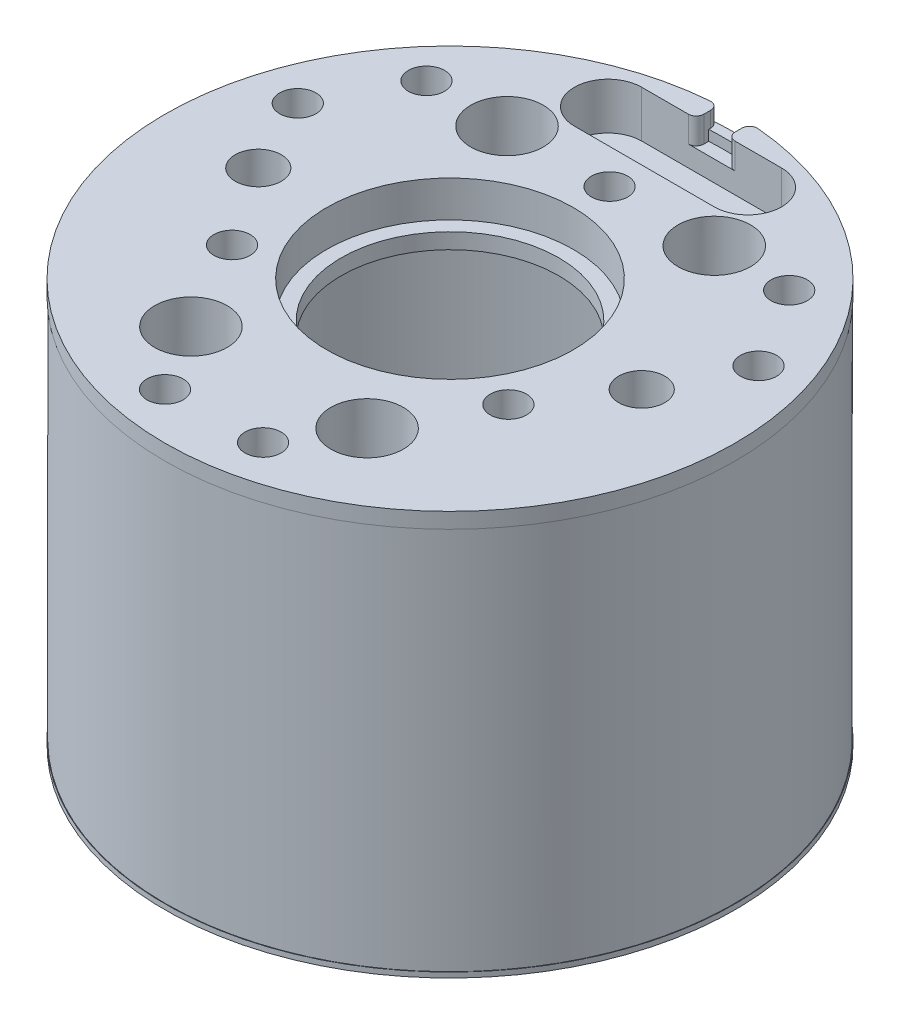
ISO-10303-21;
HEADER;
FILE_DESCRIPTION(('STEP AP214'),'2;1');
FILE_NAME('part.step','',(''),(''),'','','');
FILE_SCHEMA(('AUTOMOTIVE_DESIGN { 1 0 10303 214 1 1 1 1 }'));
ENDSEC;
DATA;
#1=APPLICATION_CONTEXT('core data for automotive mechanical design processes');
#2=APPLICATION_PROTOCOL_DEFINITION('international standard','automotive_design',2000,#1);
#3=PRODUCT_CONTEXT('',#1,'mechanical');
#4=PRODUCT('Part','Part','',(#3));
#5=PRODUCT_RELATED_PRODUCT_CATEGORY('part','',(#4));
#6=PRODUCT_DEFINITION_FORMATION('','',#4);
#7=PRODUCT_DEFINITION_CONTEXT('part definition',#1,'design');
#8=PRODUCT_DEFINITION('design','',#6,#7);
#9=PRODUCT_DEFINITION_SHAPE('','',#8);
#10=(LENGTH_UNIT() NAMED_UNIT(*) SI_UNIT(.MILLI.,.METRE.));
#11=(NAMED_UNIT(*) PLANE_ANGLE_UNIT() SI_UNIT($,.RADIAN.));
#12=(NAMED_UNIT(*) SI_UNIT($,.STERADIAN.) SOLID_ANGLE_UNIT());
#13=UNCERTAINTY_MEASURE_WITH_UNIT(LENGTH_MEASURE(1.E-05),#10,'distance_accuracy_value','');
#14=(GEOMETRIC_REPRESENTATION_CONTEXT(3) GLOBAL_UNCERTAINTY_ASSIGNED_CONTEXT((#13)) GLOBAL_UNIT_ASSIGNED_CONTEXT((#10,
#11,#12)) REPRESENTATION_CONTEXT('',''));
#15=CARTESIAN_POINT('',(0.,0.,0.));
#16=DIRECTION('',(0.,0.,1.));
#17=DIRECTION('',(1.,0.,0.));
#18=AXIS2_PLACEMENT_3D('',#15,#16,#17);
#19=CARTESIAN_POINT('',(13.462,-19.558,0.));
#20=DIRECTION('',(0.,1.,0.));
#21=DIRECTION('',(0.,0.,1.));
#22=AXIS2_PLACEMENT_3D('',#19,#20,#21);
#23=PLANE('',#22);
#24=CARTESIAN_POINT('',(0.,-19.558,0.));
#25=DIRECTION('',(0.,-1.,0.));
#26=DIRECTION('',(0.,0.,-1.));
#27=AXIS2_PLACEMENT_3D('',#24,#25,#26);
#28=CIRCLE('',#27,13.97);
#29=CARTESIAN_POINT('',(0.,-19.558,-13.97));
#30=VERTEX_POINT('',#29);
#31=EDGE_CURVE('E222',#30,#30,#28,.T.);
#32=ORIENTED_EDGE('',*,*,#31,.F.);
#33=EDGE_LOOP('',(#32));
#34=FACE_BOUND('',#33,.T.);
#35=CARTESIAN_POINT('',(0.,-19.558,0.));
#36=DIRECTION('',(0.,1.,0.));
#37=DIRECTION('',(0.,0.,1.));
#38=AXIS2_PLACEMENT_3D('',#35,#36,#37);
#39=CIRCLE('',#38,13.9446);
#40=CARTESIAN_POINT('',(0.,-19.558,13.9446));
#41=VERTEX_POINT('',#40);
#42=EDGE_CURVE('E376',#41,#41,#39,.T.);
#43=ORIENTED_EDGE('',*,*,#42,.F.);
#44=EDGE_LOOP('',(#43));
#45=FACE_BOUND('',#44,.T.);
#46=ADVANCED_FACE('F31',(#34,#45),#23,.T.);
#47=CARTESIAN_POINT('',(13.97,-0.762,0.));
#48=DIRECTION('',(0.,-1.,0.));
#49=DIRECTION('',(0.,0.,-1.));
#50=AXIS2_PLACEMENT_3D('',#47,#48,#49);
#51=PLANE('',#50);
#52=CARTESIAN_POINT('',(-1.143,-0.762,-13.540844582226));
#53=DIRECTION('',(0.,-1.,0.));
#54=DIRECTION('',(0.,0.,-1.));
#55=AXIS2_PLACEMENT_3D('',#52,#53,#54);
#56=CIRCLE('',#55,0.381);
#57=CARTESIAN_POINT('',(-1.17504672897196,-0.762000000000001,-13.9204944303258));
#58=VERTEX_POINT('',#57);
#59=CARTESIAN_POINT('',(-1.0347837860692,-0.762,-13.9061530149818));
#60=VERTEX_POINT('',#59);
#61=EDGE_CURVE('E164',#58,#60,#56,.T.);
#62=ORIENTED_EDGE('',*,*,#61,.T.);
#63=CARTESIAN_POINT('',(0.,-0.762000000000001,0.));
#64=DIRECTION('',(0.,1.,0.));
#65=DIRECTION('',(0.,0.,1.));
#66=AXIS2_PLACEMENT_3D('',#63,#64,#65);
#67=CIRCLE('',#66,13.9446);
#68=CARTESIAN_POINT('',(1.0347837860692,-0.762,-13.9061530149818));
#69=VERTEX_POINT('',#68);
#70=EDGE_CURVE('E46',#60,#69,#67,.T.);
#71=ORIENTED_EDGE('',*,*,#70,.T.);
#72=CARTESIAN_POINT('',(1.143,-0.762,-13.540844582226));
#73=DIRECTION('',(0.,-1.,0.));
#74=DIRECTION('',(0.,0.,-1.));
#75=AXIS2_PLACEMENT_3D('',#72,#73,#74);
#76=CIRCLE('',#75,0.381);
#77=CARTESIAN_POINT('',(1.17504672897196,-0.762000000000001,-13.9204944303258));
#78=VERTEX_POINT('',#77);
#79=EDGE_CURVE('E167',#69,#78,#76,.T.);
#80=ORIENTED_EDGE('',*,*,#79,.T.);
#81=CARTESIAN_POINT('',(0.,-0.762000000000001,0.));
#82=DIRECTION('',(0.,-1.,0.));
#83=DIRECTION('',(0.,0.,-1.));
#84=AXIS2_PLACEMENT_3D('',#81,#82,#83);
#85=CIRCLE('',#84,13.97);
#86=EDGE_CURVE('E225',#78,#58,#85,.T.);
#87=ORIENTED_EDGE('',*,*,#86,.T.);
#88=EDGE_LOOP('',(#62,#71,#80,#87));
#89=FACE_BOUND('',#88,.T.);
#90=ADVANCED_FACE('F393',(#89),#51,.T.);
#91=CARTESIAN_POINT('',(13.208,-2.54,0.));
#92=DIRECTION('',(0.,-1.,0.));
#93=DIRECTION('',(0.,0.,-1.));
#94=AXIS2_PLACEMENT_3D('',#91,#92,#93);
#95=PLANE('',#94);
#96=CARTESIAN_POINT('',(4.318,-2.54,8.382));
#97=DIRECTION('',(0.,-1.,0.));
#98=DIRECTION('',(0.,0.,-1.));
#99=AXIS2_PLACEMENT_3D('',#96,#97,#98);
#100=CIRCLE('',#99,1.778);
#101=CARTESIAN_POINT('',(4.318,-2.54,6.604));
#102=VERTEX_POINT('',#101);
#103=EDGE_CURVE('E327',#102,#102,#100,.T.);
#104=ORIENTED_EDGE('',*,*,#103,.F.);
#105=EDGE_LOOP('',(#104));
#106=FACE_BOUND('',#105,.T.);
#107=CARTESIAN_POINT('',(-4.318,-2.54,8.382));
#108=DIRECTION('',(0.,-1.,0.));
#109=DIRECTION('',(0.,0.,-1.));
#110=AXIS2_PLACEMENT_3D('',#107,#108,#109);
#111=CIRCLE('',#110,1.778);
#112=CARTESIAN_POINT('',(-4.318,-2.54,6.604));
#113=VERTEX_POINT('',#112);
#114=EDGE_CURVE('E321',#113,#113,#111,.T.);
#115=ORIENTED_EDGE('',*,*,#114,.F.);
#116=EDGE_LOOP('',(#115));
#117=FACE_BOUND('',#116,.T.);
#118=CARTESIAN_POINT('',(5.08,-2.54,-7.874));
#119=DIRECTION('',(0.,-1.,0.));
#120=DIRECTION('',(0.,0.,-1.));
#121=AXIS2_PLACEMENT_3D('',#118,#119,#120);
#122=CIRCLE('',#121,1.778);
#123=CARTESIAN_POINT('',(5.08,-2.54,-9.652));
#124=VERTEX_POINT('',#123);
#125=EDGE_CURVE('E315',#124,#124,#122,.T.);
#126=ORIENTED_EDGE('',*,*,#125,.F.);
#127=EDGE_LOOP('',(#126));
#128=FACE_BOUND('',#127,.T.);
#129=CARTESIAN_POINT('',(-5.08,-2.54,-7.874));
#130=DIRECTION('',(0.,-1.,0.));
#131=DIRECTION('',(0.,0.,-1.));
#132=AXIS2_PLACEMENT_3D('',#129,#130,#131);
#133=CIRCLE('',#132,1.778);
#134=CARTESIAN_POINT('',(-5.08,-2.54,-9.652));
#135=VERTEX_POINT('',#134);
#136=EDGE_CURVE('E309',#135,#135,#133,.T.);
#137=ORIENTED_EDGE('',*,*,#136,.F.);
#138=EDGE_LOOP('',(#137));
#139=FACE_BOUND('',#138,.T.);
#140=CARTESIAN_POINT('',(-9.398,-2.54,0.));
#141=DIRECTION('',(0.,-1.,0.));
#142=DIRECTION('',(0.,0.,-1.));
#143=AXIS2_PLACEMENT_3D('',#140,#141,#142);
#144=CIRCLE('',#143,1.1303);
#145=CARTESIAN_POINT('',(-9.398,-2.54,-1.1303));
#146=VERTEX_POINT('',#145);
#147=EDGE_CURVE('E303',#146,#146,#144,.T.);
#148=ORIENTED_EDGE('',*,*,#147,.F.);
#149=EDGE_LOOP('',(#148));
#150=FACE_BOUND('',#149,.T.);
#151=CARTESIAN_POINT('',(9.398,-2.54,0.));
#152=DIRECTION('',(0.,-1.,0.));
#153=DIRECTION('',(0.,0.,-1.));
#154=AXIS2_PLACEMENT_3D('',#151,#152,#153);
#155=CIRCLE('',#154,1.1303);
#156=CARTESIAN_POINT('',(9.398,-2.54,-1.1303));
#157=VERTEX_POINT('',#156);
#158=EDGE_CURVE('E297',#157,#157,#155,.T.);
#159=ORIENTED_EDGE('',*,*,#158,.F.);
#160=EDGE_LOOP('',(#159));
#161=FACE_BOUND('',#160,.T.);
#162=CARTESIAN_POINT('',(6.77382040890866,-2.54,3.91086703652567));
#163=DIRECTION('',(0.,-1.,0.));
#164=DIRECTION('',(0.,0.,-1.));
#165=AXIS2_PLACEMENT_3D('',#162,#163,#164);
#166=CIRCLE('',#165,0.888999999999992);
#167=CARTESIAN_POINT('',(6.77382040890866,-2.54,3.02186703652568));
#168=VERTEX_POINT('',#167);
#169=EDGE_CURVE('E291',#168,#168,#166,.T.);
#170=ORIENTED_EDGE('',*,*,#169,.F.);
#171=EDGE_LOOP('',(#170));
#172=FACE_BOUND('',#171,.T.);
#173=CARTESIAN_POINT('',(2.37164081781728,-2.54,11.5356657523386));
#174=DIRECTION('',(0.,-1.,0.));
#175=DIRECTION('',(0.,0.,-1.));
#176=AXIS2_PLACEMENT_3D('',#173,#174,#175);
#177=CIRCLE('',#176,0.888999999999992);
#178=CARTESIAN_POINT('',(2.37164081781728,-2.54,10.6466657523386));
#179=VERTEX_POINT('',#178);
#180=EDGE_CURVE('E285',#179,#179,#177,.T.);
#181=ORIENTED_EDGE('',*,*,#180,.F.);
#182=EDGE_LOOP('',(#181));
#183=FACE_BOUND('',#182,.T.);
#184=CARTESIAN_POINT('',(11.2616408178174,-2.54,-3.86226592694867));
#185=DIRECTION('',(0.,-1.,0.));
#186=DIRECTION('',(0.,0.,-1.));
#187=AXIS2_PLACEMENT_3D('',#184,#185,#186);
#188=CIRCLE('',#187,0.888999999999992);
#189=CARTESIAN_POINT('',(11.2616408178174,-2.54,-4.75126592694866));
#190=VERTEX_POINT('',#189);
#191=EDGE_CURVE('E279',#190,#190,#188,.T.);
#192=ORIENTED_EDGE('',*,*,#191,.F.);
#193=EDGE_LOOP('',(#192));
#194=FACE_BOUND('',#193,.T.);
#195=CARTESIAN_POINT('',(0.,-2.54,-7.82173407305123));
#196=DIRECTION('',(0.,-1.,0.));
#197=DIRECTION('',(0.,0.,-1.));
#198=AXIS2_PLACEMENT_3D('',#195,#196,#197);
#199=CIRCLE('',#198,0.888999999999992);
#200=CARTESIAN_POINT('',(0.,-2.54,-8.71073407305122));
#201=VERTEX_POINT('',#200);
#202=EDGE_CURVE('E273',#201,#201,#199,.T.);
#203=ORIENTED_EDGE('',*,*,#202,.F.);
#204=EDGE_LOOP('',(#203));
#205=FACE_BOUND('',#204,.T.);
#206=CARTESIAN_POINT('',(8.80435918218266,-2.54,-7.82173407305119));
#207=DIRECTION('',(0.,-1.,0.));
#208=DIRECTION('',(0.,0.,-1.));
#209=AXIS2_PLACEMENT_3D('',#206,#207,#208);
#210=CIRCLE('',#209,0.888999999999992);
#211=CARTESIAN_POINT('',(8.80435918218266,-2.54,-8.71073407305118));
#212=VERTEX_POINT('',#211);
#213=EDGE_CURVE('E267',#212,#212,#210,.T.);
#214=ORIENTED_EDGE('',*,*,#213,.F.);
#215=EDGE_LOOP('',(#214));
#216=FACE_BOUND('',#215,.T.);
#217=CARTESIAN_POINT('',(-8.97564081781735,-2.54,-7.82173407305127));
#218=DIRECTION('',(0.,-1.,0.));
#219=DIRECTION('',(0.,0.,-1.));
#220=AXIS2_PLACEMENT_3D('',#217,#218,#219);
#221=CIRCLE('',#220,0.888999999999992);
#222=CARTESIAN_POINT('',(-8.97564081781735,-2.54,-8.71073407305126));
#223=VERTEX_POINT('',#222);
#224=EDGE_CURVE('E261',#223,#223,#221,.T.);
#225=ORIENTED_EDGE('',*,*,#224,.F.);
#226=EDGE_LOOP('',(#225));
#227=FACE_BOUND('',#226,.T.);
#228=CARTESIAN_POINT('',(-6.77382040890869,-2.54,3.91086703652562));
#229=DIRECTION('',(0.,-1.,0.));
#230=DIRECTION('',(0.,0.,-1.));
#231=AXIS2_PLACEMENT_3D('',#228,#229,#230);
#232=CIRCLE('',#231,0.888999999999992);
#233=CARTESIAN_POINT('',(-6.77382040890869,-2.54,3.02186703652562));
#234=VERTEX_POINT('',#233);
#235=EDGE_CURVE('E255',#234,#234,#232,.T.);
#236=ORIENTED_EDGE('',*,*,#235,.F.);
#237=EDGE_LOOP('',(#236));
#238=FACE_BOUND('',#237,.T.);
#239=CARTESIAN_POINT('',(-11.176,-2.54,-3.71393167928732));
#240=DIRECTION('',(0.,-1.,0.));
#241=DIRECTION('',(0.,0.,-1.));
#242=AXIS2_PLACEMENT_3D('',#239,#240,#241);
#243=CIRCLE('',#242,0.888999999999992);
#244=CARTESIAN_POINT('',(-11.176,-2.54,-4.60293167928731));
#245=VERTEX_POINT('',#244);
#246=EDGE_CURVE('E249',#245,#245,#243,.T.);
#247=ORIENTED_EDGE('',*,*,#246,.F.);
#248=EDGE_LOOP('',(#247));
#249=FACE_BOUND('',#248,.T.);
#250=CARTESIAN_POINT('',(-2.286,-2.54,11.684));
#251=DIRECTION('',(0.,-1.,0.));
#252=DIRECTION('',(0.,0.,-1.));
#253=AXIS2_PLACEMENT_3D('',#250,#251,#252);
#254=CIRCLE('',#253,0.888999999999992);
#255=CARTESIAN_POINT('',(-2.286,-2.54,10.795));
#256=VERTEX_POINT('',#255);
#257=EDGE_CURVE('E243',#256,#256,#254,.T.);
#258=ORIENTED_EDGE('',*,*,#257,.F.);
#259=EDGE_LOOP('',(#258));
#260=FACE_BOUND('',#259,.T.);
#261=CARTESIAN_POINT('',(0.,-2.54,0.));
#262=DIRECTION('',(0.,-1.,0.));
#263=DIRECTION('',(0.,0.,-1.));
#264=AXIS2_PLACEMENT_3D('',#261,#262,#263);
#265=CIRCLE('',#264,13.208);
#266=CARTESIAN_POINT('',(0.,-2.54,-13.208));
#267=VERTEX_POINT('',#266);
#268=EDGE_CURVE('E212',#267,#267,#265,.T.);
#269=ORIENTED_EDGE('',*,*,#268,.T.);
#270=EDGE_LOOP('',(#269));
#271=FACE_BOUND('',#270,.T.);
#272=CARTESIAN_POINT('',(0.,-2.54,0.));
#273=DIRECTION('',(0.,-1.,0.));
#274=DIRECTION('',(0.,0.,-1.));
#275=AXIS2_PLACEMENT_3D('',#272,#273,#274);
#276=CIRCLE('',#275,5.334);
#277=CARTESIAN_POINT('',(0.,-2.54,-5.334));
#278=VERTEX_POINT('',#277);
#279=EDGE_CURVE('E240',#278,#278,#276,.T.);
#280=ORIENTED_EDGE('',*,*,#279,.F.);
#281=EDGE_LOOP('',(#280));
#282=FACE_BOUND('',#281,.T.);
#283=ADVANCED_FACE('F411',(#106,#117,#128,#139,#150,#161,#172,#183,#194,#205,#216,#227,#238,
#249,#260,#271,#282),#95,.T.);
#284=CARTESIAN_POINT('',(0.,0.,0.));
#285=DIRECTION('',(0.,-1.,0.));
#286=DIRECTION('',(0.,0.,-1.));
#287=AXIS2_PLACEMENT_3D('',#284,#285,#286);
#288=CYLINDRICAL_SURFACE('',#287,13.208);
#289=CARTESIAN_POINT('',(0.,-19.812,0.));
#290=DIRECTION('',(0.,-1.,0.));
#291=DIRECTION('',(0.,0.,-1.));
#292=AXIS2_PLACEMENT_3D('',#289,#290,#291);
#293=CIRCLE('',#292,13.208);
#294=CARTESIAN_POINT('',(0.,-19.812,-13.208));
#295=VERTEX_POINT('',#294);
#296=EDGE_CURVE('E214',#295,#295,#293,.T.);
#297=ORIENTED_EDGE('',*,*,#296,.T.);
#298=EDGE_LOOP('',(#297));
#299=FACE_BOUND('',#298,.T.);
#300=ORIENTED_EDGE('',*,*,#268,.F.);
#301=EDGE_LOOP('',(#300));
#302=FACE_BOUND('',#301,.T.);
#303=ADVANCED_FACE('F423',(#299,#302),#288,.F.);
#304=CARTESIAN_POINT('',(13.97,-19.812,0.));
#305=DIRECTION('',(0.,-1.,0.));
#306=DIRECTION('',(0.,0.,-1.));
#307=AXIS2_PLACEMENT_3D('',#304,#305,#306);
#308=PLANE('',#307);
#309=CARTESIAN_POINT('',(0.,-19.812,0.));
#310=DIRECTION('',(0.,-1.,0.));
#311=DIRECTION('',(0.,0.,-1.));
#312=AXIS2_PLACEMENT_3D('',#309,#310,#311);
#313=CIRCLE('',#312,13.97);
#314=CARTESIAN_POINT('',(0.,-19.812,-13.97));
#315=VERTEX_POINT('',#314);
#316=EDGE_CURVE('E219',#315,#315,#313,.T.);
#317=ORIENTED_EDGE('',*,*,#316,.T.);
#318=EDGE_LOOP('',(#317));
#319=FACE_BOUND('',#318,.T.);
#320=ORIENTED_EDGE('',*,*,#296,.F.);
#321=EDGE_LOOP('',(#320));
#322=FACE_BOUND('',#321,.T.);
#323=ADVANCED_FACE('F419',(#319,#322),#308,.T.);
#324=CARTESIAN_POINT('',(0.,0.,0.));
#325=DIRECTION('',(0.,-1.,0.));
#326=DIRECTION('',(0.,0.,-1.));
#327=AXIS2_PLACEMENT_3D('',#324,#325,#326);
#328=CYLINDRICAL_SURFACE('',#327,13.97);
#329=ORIENTED_EDGE('',*,*,#31,.T.);
#330=EDGE_LOOP('',(#329));
#331=FACE_BOUND('',#330,.T.);
#332=ORIENTED_EDGE('',*,*,#316,.F.);
#333=EDGE_LOOP('',(#332));
#334=FACE_BOUND('',#333,.T.);
#335=ADVANCED_FACE('F416',(#331,#334),#328,.T.);
#336=CARTESIAN_POINT('',(0.,0.,0.));
#337=DIRECTION('',(0.,-1.,0.));
#338=DIRECTION('',(0.,0.,-1.));
#339=AXIS2_PLACEMENT_3D('',#336,#337,#338);
#340=CYLINDRICAL_SURFACE('',#339,13.97);
#341=ORIENTED_EDGE('',*,*,#86,.F.);
#342=DIRECTION('',(0.,-1.,0.));
#343=VECTOR('',#342,1.);
#344=CARTESIAN_POINT('',(1.17504672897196,0.,-13.9204944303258));
#345=LINE('',#344,#343);
#346=CARTESIAN_POINT('',(1.17504672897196,0.,-13.9204944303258));
#347=VERTEX_POINT('',#346);
#348=EDGE_CURVE('E177',#78,#347,#345,.F.);
#349=ORIENTED_EDGE('',*,*,#348,.T.);
#350=CARTESIAN_POINT('',(0.,0.,0.));
#351=DIRECTION('',(0.,-1.,0.));
#352=DIRECTION('',(0.,0.,-1.));
#353=AXIS2_PLACEMENT_3D('',#350,#351,#352);
#354=CIRCLE('',#353,13.97);
#355=CARTESIAN_POINT('',(-1.17504672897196,0.,-13.9204944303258));
#356=VERTEX_POINT('',#355);
#357=EDGE_CURVE('E228',#347,#356,#354,.T.);
#358=ORIENTED_EDGE('',*,*,#357,.T.);
#359=DIRECTION('',(0.,-1.,0.));
#360=VECTOR('',#359,1.);
#361=CARTESIAN_POINT('',(-1.17504672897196,0.,-13.9204944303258));
#362=LINE('',#361,#360);
#363=EDGE_CURVE('E175',#356,#58,#362,.T.);
#364=ORIENTED_EDGE('',*,*,#363,.T.);
#365=EDGE_LOOP('',(#341,#349,#358,#364));
#366=FACE_BOUND('',#365,.T.);
#367=ADVANCED_FACE('F395',(#366),#340,.T.);
#368=CARTESIAN_POINT('',(6.0452,0.,0.));
#369=DIRECTION('',(0.,1.,0.));
#370=DIRECTION('',(0.,0.,1.));
#371=AXIS2_PLACEMENT_3D('',#368,#369,#370);
#372=PLANE('',#371);
#373=ORIENTED_EDGE('',*,*,#357,.F.);
#374=CARTESIAN_POINT('',(1.143,0.,-13.540844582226));
#375=DIRECTION('',(0.,1.,0.));
#376=DIRECTION('',(0.,0.,1.));
#377=AXIS2_PLACEMENT_3D('',#374,#375,#376);
#378=CIRCLE('',#377,0.381);
#379=CARTESIAN_POINT('',(0.762,0.,-13.540844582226));
#380=VERTEX_POINT('',#379);
#381=EDGE_CURVE('E184',#347,#380,#378,.T.);
#382=ORIENTED_EDGE('',*,*,#381,.T.);
#383=DIRECTION('',(0.,0.,-1.));
#384=VECTOR('',#383,1.);
#385=CARTESIAN_POINT('',(0.762,0.,-13.97));
#386=LINE('',#385,#384);
#387=CARTESIAN_POINT('',(0.762,0.,-13.208));
#388=VERTEX_POINT('',#387);
#389=EDGE_CURVE('E372',#388,#380,#386,.T.);
#390=ORIENTED_EDGE('',*,*,#389,.F.);
#391=CARTESIAN_POINT('',(1.143,0.,-13.208));
#392=DIRECTION('',(0.,1.,0.));
#393=DIRECTION('',(0.,0.,1.));
#394=AXIS2_PLACEMENT_3D('',#391,#392,#393);
#395=CIRCLE('',#394,0.381);
#396=CARTESIAN_POINT('',(1.143,0.,-12.827));
#397=VERTEX_POINT('',#396);
#398=EDGE_CURVE('E181',#388,#397,#395,.T.);
#399=ORIENTED_EDGE('',*,*,#398,.T.);
#400=DIRECTION('',(-1.,0.,0.));
#401=VECTOR('',#400,1.);
#402=CARTESIAN_POINT('',(-3.429,0.,-12.827));
#403=LINE('',#402,#401);
#404=CARTESIAN_POINT('',(3.429,0.,-12.827));
#405=VERTEX_POINT('',#404);
#406=EDGE_CURVE('E344',#405,#397,#403,.T.);
#407=ORIENTED_EDGE('',*,*,#406,.F.);
#408=CARTESIAN_POINT('',(3.429,0.,-11.176));
#409=DIRECTION('',(0.,1.,0.));
#410=DIRECTION('',(0.,0.,1.));
#411=AXIS2_PLACEMENT_3D('',#408,#409,#410);
#412=CIRCLE('',#411,1.651);
#413=CARTESIAN_POINT('',(3.429,0.,-9.525));
#414=VERTEX_POINT('',#413);
#415=EDGE_CURVE('E349',#414,#405,#412,.T.);
#416=ORIENTED_EDGE('',*,*,#415,.F.);
#417=DIRECTION('',(1.,0.,0.));
#418=VECTOR('',#417,1.);
#419=CARTESIAN_POINT('',(-3.429,0.,-9.525));
#420=LINE('',#419,#418);
#421=CARTESIAN_POINT('',(-3.429,0.,-9.525));
#422=VERTEX_POINT('',#421);
#423=EDGE_CURVE('E352',#422,#414,#420,.T.);
#424=ORIENTED_EDGE('',*,*,#423,.F.);
#425=CARTESIAN_POINT('',(-3.429,0.,-11.176));
#426=DIRECTION('',(0.,1.,0.));
#427=DIRECTION('',(0.,0.,1.));
#428=AXIS2_PLACEMENT_3D('',#425,#426,#427);
#429=CIRCLE('',#428,1.651);
#430=CARTESIAN_POINT('',(-3.429,0.,-12.827));
#431=VERTEX_POINT('',#430);
#432=EDGE_CURVE('E355',#431,#422,#429,.T.);
#433=ORIENTED_EDGE('',*,*,#432,.F.);
#434=CARTESIAN_POINT('',(-1.143,0.,-12.827));
#435=VERTEX_POINT('',#434);
#436=EDGE_CURVE('E348',#435,#431,#403,.T.);
#437=ORIENTED_EDGE('',*,*,#436,.F.);
#438=CARTESIAN_POINT('',(-1.143,0.,-13.208));
#439=DIRECTION('',(0.,1.,0.));
#440=DIRECTION('',(0.,0.,1.));
#441=AXIS2_PLACEMENT_3D('',#438,#439,#440);
#442=CIRCLE('',#441,0.381);
#443=CARTESIAN_POINT('',(-0.762,0.,-13.208));
#444=VERTEX_POINT('',#443);
#445=EDGE_CURVE('E179',#435,#444,#442,.T.);
#446=ORIENTED_EDGE('',*,*,#445,.T.);
#447=DIRECTION('',(0.,0.,1.));
#448=VECTOR('',#447,1.);
#449=CARTESIAN_POINT('',(-0.762,0.,-13.97));
#450=LINE('',#449,#448);
#451=CARTESIAN_POINT('',(-0.762,0.,-13.540844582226));
#452=VERTEX_POINT('',#451);
#453=EDGE_CURVE('E375',#452,#444,#450,.T.);
#454=ORIENTED_EDGE('',*,*,#453,.F.);
#455=CARTESIAN_POINT('',(-1.143,0.,-13.540844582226));
#456=DIRECTION('',(0.,1.,0.));
#457=DIRECTION('',(0.,0.,1.));
#458=AXIS2_PLACEMENT_3D('',#455,#456,#457);
#459=CIRCLE('',#458,0.381);
#460=EDGE_CURVE('E141',#452,#356,#459,.T.);
#461=ORIENTED_EDGE('',*,*,#460,.T.);
#462=EDGE_LOOP('',(#373,#382,#390,#399,#407,#416,#424,#433,#437,#446,#454,#461));
#463=FACE_BOUND('',#462,.T.);
#464=CARTESIAN_POINT('',(4.318,0.,8.382));
#465=DIRECTION('',(0.,1.,0.));
#466=DIRECTION('',(0.,0.,1.));
#467=AXIS2_PLACEMENT_3D('',#464,#465,#466);
#468=CIRCLE('',#467,1.778);
#469=CARTESIAN_POINT('',(4.318,0.,10.16));
#470=VERTEX_POINT('',#469);
#471=EDGE_CURVE('E330',#470,#470,#468,.T.);
#472=ORIENTED_EDGE('',*,*,#471,.F.);
#473=EDGE_LOOP('',(#472));
#474=FACE_BOUND('',#473,.T.);
#475=CARTESIAN_POINT('',(-4.318,0.,8.382));
#476=DIRECTION('',(0.,1.,0.));
#477=DIRECTION('',(0.,0.,1.));
#478=AXIS2_PLACEMENT_3D('',#475,#476,#477);
#479=CIRCLE('',#478,1.778);
#480=CARTESIAN_POINT('',(-4.318,0.,10.16));
#481=VERTEX_POINT('',#480);
#482=EDGE_CURVE('E324',#481,#481,#479,.T.);
#483=ORIENTED_EDGE('',*,*,#482,.F.);
#484=EDGE_LOOP('',(#483));
#485=FACE_BOUND('',#484,.T.);
#486=CARTESIAN_POINT('',(5.08,0.,-7.874));
#487=DIRECTION('',(0.,1.,0.));
#488=DIRECTION('',(0.,0.,1.));
#489=AXIS2_PLACEMENT_3D('',#486,#487,#488);
#490=CIRCLE('',#489,1.778);
#491=CARTESIAN_POINT('',(5.08,0.,-6.096));
#492=VERTEX_POINT('',#491);
#493=EDGE_CURVE('E318',#492,#492,#490,.T.);
#494=ORIENTED_EDGE('',*,*,#493,.F.);
#495=EDGE_LOOP('',(#494));
#496=FACE_BOUND('',#495,.T.);
#497=CARTESIAN_POINT('',(-5.08,0.,-7.874));
#498=DIRECTION('',(0.,1.,0.));
#499=DIRECTION('',(0.,0.,1.));
#500=AXIS2_PLACEMENT_3D('',#497,#498,#499);
#501=CIRCLE('',#500,1.778);
#502=CARTESIAN_POINT('',(-5.08,0.,-6.096));
#503=VERTEX_POINT('',#502);
#504=EDGE_CURVE('E312',#503,#503,#501,.T.);
#505=ORIENTED_EDGE('',*,*,#504,.F.);
#506=EDGE_LOOP('',(#505));
#507=FACE_BOUND('',#506,.T.);
#508=CARTESIAN_POINT('',(-9.398,0.,0.));
#509=DIRECTION('',(0.,1.,0.));
#510=DIRECTION('',(0.,0.,1.));
#511=AXIS2_PLACEMENT_3D('',#508,#509,#510);
#512=CIRCLE('',#511,1.1303);
#513=CARTESIAN_POINT('',(-9.398,0.,1.1303));
#514=VERTEX_POINT('',#513);
#515=EDGE_CURVE('E306',#514,#514,#512,.T.);
#516=ORIENTED_EDGE('',*,*,#515,.F.);
#517=EDGE_LOOP('',(#516));
#518=FACE_BOUND('',#517,.T.);
#519=CARTESIAN_POINT('',(9.398,0.,0.));
#520=DIRECTION('',(0.,1.,0.));
#521=DIRECTION('',(0.,0.,1.));
#522=AXIS2_PLACEMENT_3D('',#519,#520,#521);
#523=CIRCLE('',#522,1.1303);
#524=CARTESIAN_POINT('',(9.398,0.,1.1303));
#525=VERTEX_POINT('',#524);
#526=EDGE_CURVE('E300',#525,#525,#523,.T.);
#527=ORIENTED_EDGE('',*,*,#526,.F.);
#528=EDGE_LOOP('',(#527));
#529=FACE_BOUND('',#528,.T.);
#530=CARTESIAN_POINT('',(6.77382040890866,0.,3.91086703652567));
#531=DIRECTION('',(0.,1.,0.));
#532=DIRECTION('',(0.,0.,1.));
#533=AXIS2_PLACEMENT_3D('',#530,#531,#532);
#534=CIRCLE('',#533,0.888999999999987);
#535=CARTESIAN_POINT('',(6.77382040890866,0.,4.79986703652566));
#536=VERTEX_POINT('',#535);
#537=EDGE_CURVE('E294',#536,#536,#534,.T.);
#538=ORIENTED_EDGE('',*,*,#537,.F.);
#539=EDGE_LOOP('',(#538));
#540=FACE_BOUND('',#539,.T.);
#541=CARTESIAN_POINT('',(2.37164081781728,0.,11.5356657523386));
#542=DIRECTION('',(0.,1.,0.));
#543=DIRECTION('',(0.,0.,1.));
#544=AXIS2_PLACEMENT_3D('',#541,#542,#543);
#545=CIRCLE('',#544,0.888999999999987);
#546=CARTESIAN_POINT('',(2.37164081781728,0.,12.4246657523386));
#547=VERTEX_POINT('',#546);
#548=EDGE_CURVE('E288',#547,#547,#545,.T.);
#549=ORIENTED_EDGE('',*,*,#548,.F.);
#550=EDGE_LOOP('',(#549));
#551=FACE_BOUND('',#550,.T.);
#552=CARTESIAN_POINT('',(11.2616408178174,0.,-3.86226592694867));
#553=DIRECTION('',(0.,1.,0.));
#554=DIRECTION('',(0.,0.,1.));
#555=AXIS2_PLACEMENT_3D('',#552,#553,#554);
#556=CIRCLE('',#555,0.888999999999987);
#557=CARTESIAN_POINT('',(11.2616408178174,0.,-2.97326592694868));
#558=VERTEX_POINT('',#557);
#559=EDGE_CURVE('E282',#558,#558,#556,.T.);
#560=ORIENTED_EDGE('',*,*,#559,.F.);
#561=EDGE_LOOP('',(#560));
#562=FACE_BOUND('',#561,.T.);
#563=CARTESIAN_POINT('',(0.,0.,-7.82173407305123));
#564=DIRECTION('',(0.,1.,0.));
#565=DIRECTION('',(0.,0.,1.));
#566=AXIS2_PLACEMENT_3D('',#563,#564,#565);
#567=CIRCLE('',#566,0.888999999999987);
#568=CARTESIAN_POINT('',(0.,0.,-6.93273407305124));
#569=VERTEX_POINT('',#568);
#570=EDGE_CURVE('E276',#569,#569,#567,.T.);
#571=ORIENTED_EDGE('',*,*,#570,.F.);
#572=EDGE_LOOP('',(#571));
#573=FACE_BOUND('',#572,.T.);
#574=CARTESIAN_POINT('',(8.80435918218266,0.,-7.82173407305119));
#575=DIRECTION('',(0.,1.,0.));
#576=DIRECTION('',(0.,0.,1.));
#577=AXIS2_PLACEMENT_3D('',#574,#575,#576);
#578=CIRCLE('',#577,0.888999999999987);
#579=CARTESIAN_POINT('',(8.80435918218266,0.,-6.9327340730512));
#580=VERTEX_POINT('',#579);
#581=EDGE_CURVE('E270',#580,#580,#578,.T.);
#582=ORIENTED_EDGE('',*,*,#581,.F.);
#583=EDGE_LOOP('',(#582));
#584=FACE_BOUND('',#583,.T.);
#585=CARTESIAN_POINT('',(-8.97564081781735,0.,-7.82173407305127));
#586=DIRECTION('',(0.,1.,0.));
#587=DIRECTION('',(0.,0.,1.));
#588=AXIS2_PLACEMENT_3D('',#585,#586,#587);
#589=CIRCLE('',#588,0.888999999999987);
#590=CARTESIAN_POINT('',(-8.97564081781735,0.,-6.93273407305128));
#591=VERTEX_POINT('',#590);
#592=EDGE_CURVE('E264',#591,#591,#589,.T.);
#593=ORIENTED_EDGE('',*,*,#592,.F.);
#594=EDGE_LOOP('',(#593));
#595=FACE_BOUND('',#594,.T.);
#596=CARTESIAN_POINT('',(-6.77382040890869,0.,3.91086703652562));
#597=DIRECTION('',(0.,1.,0.));
#598=DIRECTION('',(0.,0.,1.));
#599=AXIS2_PLACEMENT_3D('',#596,#597,#598);
#600=CIRCLE('',#599,0.888999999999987);
#601=CARTESIAN_POINT('',(-6.77382040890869,0.,4.7998670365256));
#602=VERTEX_POINT('',#601);
#603=EDGE_CURVE('E258',#602,#602,#600,.T.);
#604=ORIENTED_EDGE('',*,*,#603,.F.);
#605=EDGE_LOOP('',(#604));
#606=FACE_BOUND('',#605,.T.);
#607=CARTESIAN_POINT('',(-11.176,0.,-3.71393167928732));
#608=DIRECTION('',(0.,1.,0.));
#609=DIRECTION('',(0.,0.,1.));
#610=AXIS2_PLACEMENT_3D('',#607,#608,#609);
#611=CIRCLE('',#610,0.888999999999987);
#612=CARTESIAN_POINT('',(-11.176,0.,-2.82493167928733));
#613=VERTEX_POINT('',#612);
#614=EDGE_CURVE('E252',#613,#613,#611,.T.);
#615=ORIENTED_EDGE('',*,*,#614,.F.);
#616=EDGE_LOOP('',(#615));
#617=FACE_BOUND('',#616,.T.);
#618=CARTESIAN_POINT('',(-2.286,0.,11.684));
#619=DIRECTION('',(0.,1.,0.));
#620=DIRECTION('',(0.,0.,1.));
#621=AXIS2_PLACEMENT_3D('',#618,#619,#620);
#622=CIRCLE('',#621,0.888999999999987);
#623=CARTESIAN_POINT('',(-2.286,0.,12.573));
#624=VERTEX_POINT('',#623);
#625=EDGE_CURVE('E246',#624,#624,#622,.T.);
#626=ORIENTED_EDGE('',*,*,#625,.F.);
#627=EDGE_LOOP('',(#626));
#628=FACE_BOUND('',#627,.T.);
#629=CARTESIAN_POINT('',(0.,0.,0.));
#630=DIRECTION('',(0.,-1.,0.));
#631=DIRECTION('',(0.,0.,-1.));
#632=AXIS2_PLACEMENT_3D('',#629,#630,#631);
#633=CIRCLE('',#632,6.0452);
#634=CARTESIAN_POINT('',(0.,0.,-6.0452));
#635=VERTEX_POINT('',#634);
#636=EDGE_CURVE('E231',#635,#635,#633,.T.);
#637=ORIENTED_EDGE('',*,*,#636,.T.);
#638=EDGE_LOOP('',(#637));
#639=FACE_BOUND('',#638,.T.);
#640=ADVANCED_FACE('F446',(#463,#474,#485,#496,#507,#518,#529,#540,#551,#562,#573,#584,#595,
#606,#617,#628,#639),#372,.T.);
#641=CARTESIAN_POINT('',(0.,0.,0.));
#642=DIRECTION('',(0.,-1.,0.));
#643=DIRECTION('',(0.,0.,-1.));
#644=AXIS2_PLACEMENT_3D('',#641,#642,#643);
#645=CYLINDRICAL_SURFACE('',#644,6.0452);
#646=CARTESIAN_POINT('',(0.,-1.778,0.));
#647=DIRECTION('',(0.,-1.,0.));
#648=DIRECTION('',(0.,0.,-1.));
#649=AXIS2_PLACEMENT_3D('',#646,#647,#648);
#650=CIRCLE('',#649,6.0452);
#651=CARTESIAN_POINT('',(0.,-1.778,-6.0452));
#652=VERTEX_POINT('',#651);
#653=EDGE_CURVE('E234',#652,#652,#650,.T.);
#654=ORIENTED_EDGE('',*,*,#653,.T.);
#655=EDGE_LOOP('',(#654));
#656=FACE_BOUND('',#655,.T.);
#657=ORIENTED_EDGE('',*,*,#636,.F.);
#658=EDGE_LOOP('',(#657));
#659=FACE_BOUND('',#658,.T.);
#660=ADVANCED_FACE('F551',(#656,#659),#645,.F.);
#661=CARTESIAN_POINT('',(6.0452,-1.778,0.));
#662=DIRECTION('',(0.,1.,0.));
#663=DIRECTION('',(0.,0.,1.));
#664=AXIS2_PLACEMENT_3D('',#661,#662,#663);
#665=PLANE('',#664);
#666=CARTESIAN_POINT('',(0.,-1.778,0.));
#667=DIRECTION('',(0.,-1.,0.));
#668=DIRECTION('',(0.,0.,-1.));
#669=AXIS2_PLACEMENT_3D('',#666,#667,#668);
#670=CIRCLE('',#669,5.334);
#671=CARTESIAN_POINT('',(0.,-1.778,-5.334));
#672=VERTEX_POINT('',#671);
#673=EDGE_CURVE('E237',#672,#672,#670,.T.);
#674=ORIENTED_EDGE('',*,*,#673,.T.);
#675=EDGE_LOOP('',(#674));
#676=FACE_BOUND('',#675,.T.);
#677=ORIENTED_EDGE('',*,*,#653,.F.);
#678=EDGE_LOOP('',(#677));
#679=FACE_BOUND('',#678,.T.);
#680=ADVANCED_FACE('F547',(#676,#679),#665,.T.);
#681=CARTESIAN_POINT('',(0.,0.,0.));
#682=DIRECTION('',(0.,-1.,0.));
#683=DIRECTION('',(0.,0.,-1.));
#684=AXIS2_PLACEMENT_3D('',#681,#682,#683);
#685=CYLINDRICAL_SURFACE('',#684,5.334);
#686=ORIENTED_EDGE('',*,*,#279,.T.);
#687=EDGE_LOOP('',(#686));
#688=FACE_BOUND('',#687,.T.);
#689=ORIENTED_EDGE('',*,*,#673,.F.);
#690=EDGE_LOOP('',(#689));
#691=FACE_BOUND('',#690,.T.);
#692=ADVANCED_FACE('F543',(#688,#691),#685,.F.);
#693=CARTESIAN_POINT('',(-2.286,0.,11.684));
#694=DIRECTION('',(0.,1.,0.));
#695=DIRECTION('',(0.,0.,1.));
#696=AXIS2_PLACEMENT_3D('',#693,#694,#695);
#697=CYLINDRICAL_SURFACE('',#696,0.888999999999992);
#698=ORIENTED_EDGE('',*,*,#257,.T.);
#699=EDGE_LOOP('',(#698));
#700=FACE_BOUND('',#699,.T.);
#701=ORIENTED_EDGE('',*,*,#625,.T.);
#702=EDGE_LOOP('',(#701));
#703=FACE_BOUND('',#702,.T.);
#704=ADVANCED_FACE('F539',(#700,#703),#697,.F.);
#705=CARTESIAN_POINT('',(-11.176,0.,-3.71393167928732));
#706=DIRECTION('',(0.,1.,0.));
#707=DIRECTION('',(0.,0.,1.));
#708=AXIS2_PLACEMENT_3D('',#705,#706,#707);
#709=CYLINDRICAL_SURFACE('',#708,0.888999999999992);
#710=ORIENTED_EDGE('',*,*,#246,.T.);
#711=EDGE_LOOP('',(#710));
#712=FACE_BOUND('',#711,.T.);
#713=ORIENTED_EDGE('',*,*,#614,.T.);
#714=EDGE_LOOP('',(#713));
#715=FACE_BOUND('',#714,.T.);
#716=ADVANCED_FACE('F535',(#712,#715),#709,.F.);
#717=CARTESIAN_POINT('',(-6.77382040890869,0.,3.91086703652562));
#718=DIRECTION('',(0.,1.,0.));
#719=DIRECTION('',(0.,0.,1.));
#720=AXIS2_PLACEMENT_3D('',#717,#718,#719);
#721=CYLINDRICAL_SURFACE('',#720,0.888999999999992);
#722=ORIENTED_EDGE('',*,*,#235,.T.);
#723=EDGE_LOOP('',(#722));
#724=FACE_BOUND('',#723,.T.);
#725=ORIENTED_EDGE('',*,*,#603,.T.);
#726=EDGE_LOOP('',(#725));
#727=FACE_BOUND('',#726,.T.);
#728=ADVANCED_FACE('F531',(#724,#727),#721,.F.);
#729=CARTESIAN_POINT('',(-8.97564081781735,0.,-7.82173407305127));
#730=DIRECTION('',(0.,1.,0.));
#731=DIRECTION('',(0.,0.,1.));
#732=AXIS2_PLACEMENT_3D('',#729,#730,#731);
#733=CYLINDRICAL_SURFACE('',#732,0.888999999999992);
#734=ORIENTED_EDGE('',*,*,#224,.T.);
#735=EDGE_LOOP('',(#734));
#736=FACE_BOUND('',#735,.T.);
#737=ORIENTED_EDGE('',*,*,#592,.T.);
#738=EDGE_LOOP('',(#737));
#739=FACE_BOUND('',#738,.T.);
#740=ADVANCED_FACE('F527',(#736,#739),#733,.F.);
#741=CARTESIAN_POINT('',(8.80435918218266,0.,-7.82173407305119));
#742=DIRECTION('',(0.,1.,0.));
#743=DIRECTION('',(0.,0.,1.));
#744=AXIS2_PLACEMENT_3D('',#741,#742,#743);
#745=CYLINDRICAL_SURFACE('',#744,0.888999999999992);
#746=ORIENTED_EDGE('',*,*,#213,.T.);
#747=EDGE_LOOP('',(#746));
#748=FACE_BOUND('',#747,.T.);
#749=ORIENTED_EDGE('',*,*,#581,.T.);
#750=EDGE_LOOP('',(#749));
#751=FACE_BOUND('',#750,.T.);
#752=ADVANCED_FACE('F523',(#748,#751),#745,.F.);
#753=CARTESIAN_POINT('',(0.,0.,-7.82173407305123));
#754=DIRECTION('',(0.,1.,0.));
#755=DIRECTION('',(0.,0.,1.));
#756=AXIS2_PLACEMENT_3D('',#753,#754,#755);
#757=CYLINDRICAL_SURFACE('',#756,0.888999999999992);
#758=ORIENTED_EDGE('',*,*,#202,.T.);
#759=EDGE_LOOP('',(#758));
#760=FACE_BOUND('',#759,.T.);
#761=ORIENTED_EDGE('',*,*,#570,.T.);
#762=EDGE_LOOP('',(#761));
#763=FACE_BOUND('',#762,.T.);
#764=ADVANCED_FACE('F519',(#760,#763),#757,.F.);
#765=CARTESIAN_POINT('',(11.2616408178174,0.,-3.86226592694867));
#766=DIRECTION('',(0.,1.,0.));
#767=DIRECTION('',(0.,0.,1.));
#768=AXIS2_PLACEMENT_3D('',#765,#766,#767);
#769=CYLINDRICAL_SURFACE('',#768,0.888999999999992);
#770=ORIENTED_EDGE('',*,*,#191,.T.);
#771=EDGE_LOOP('',(#770));
#772=FACE_BOUND('',#771,.T.);
#773=ORIENTED_EDGE('',*,*,#559,.T.);
#774=EDGE_LOOP('',(#773));
#775=FACE_BOUND('',#774,.T.);
#776=ADVANCED_FACE('F515',(#772,#775),#769,.F.);
#777=CARTESIAN_POINT('',(2.37164081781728,0.,11.5356657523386));
#778=DIRECTION('',(0.,1.,0.));
#779=DIRECTION('',(0.,0.,1.));
#780=AXIS2_PLACEMENT_3D('',#777,#778,#779);
#781=CYLINDRICAL_SURFACE('',#780,0.888999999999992);
#782=ORIENTED_EDGE('',*,*,#180,.T.);
#783=EDGE_LOOP('',(#782));
#784=FACE_BOUND('',#783,.T.);
#785=ORIENTED_EDGE('',*,*,#548,.T.);
#786=EDGE_LOOP('',(#785));
#787=FACE_BOUND('',#786,.T.);
#788=ADVANCED_FACE('F511',(#784,#787),#781,.F.);
#789=CARTESIAN_POINT('',(6.77382040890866,0.,3.91086703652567));
#790=DIRECTION('',(0.,1.,0.));
#791=DIRECTION('',(0.,0.,1.));
#792=AXIS2_PLACEMENT_3D('',#789,#790,#791);
#793=CYLINDRICAL_SURFACE('',#792,0.888999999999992);
#794=ORIENTED_EDGE('',*,*,#169,.T.);
#795=EDGE_LOOP('',(#794));
#796=FACE_BOUND('',#795,.T.);
#797=ORIENTED_EDGE('',*,*,#537,.T.);
#798=EDGE_LOOP('',(#797));
#799=FACE_BOUND('',#798,.T.);
#800=ADVANCED_FACE('F507',(#796,#799),#793,.F.);
#801=CARTESIAN_POINT('',(9.398,0.,0.));
#802=DIRECTION('',(0.,1.,0.));
#803=DIRECTION('',(0.,0.,1.));
#804=AXIS2_PLACEMENT_3D('',#801,#802,#803);
#805=CYLINDRICAL_SURFACE('',#804,1.1303);
#806=ORIENTED_EDGE('',*,*,#158,.T.);
#807=EDGE_LOOP('',(#806));
#808=FACE_BOUND('',#807,.T.);
#809=ORIENTED_EDGE('',*,*,#526,.T.);
#810=EDGE_LOOP('',(#809));
#811=FACE_BOUND('',#810,.T.);
#812=ADVANCED_FACE('F503',(#808,#811),#805,.F.);
#813=CARTESIAN_POINT('',(-9.398,0.,0.));
#814=DIRECTION('',(0.,1.,0.));
#815=DIRECTION('',(0.,0.,1.));
#816=AXIS2_PLACEMENT_3D('',#813,#814,#815);
#817=CYLINDRICAL_SURFACE('',#816,1.1303);
#818=ORIENTED_EDGE('',*,*,#147,.T.);
#819=EDGE_LOOP('',(#818));
#820=FACE_BOUND('',#819,.T.);
#821=ORIENTED_EDGE('',*,*,#515,.T.);
#822=EDGE_LOOP('',(#821));
#823=FACE_BOUND('',#822,.T.);
#824=ADVANCED_FACE('F499',(#820,#823),#817,.F.);
#825=CARTESIAN_POINT('',(-5.08,-19.812,-7.874));
#826=DIRECTION('',(0.,1.,0.));
#827=DIRECTION('',(0.,0.,1.));
#828=AXIS2_PLACEMENT_3D('',#825,#826,#827);
#829=CYLINDRICAL_SURFACE('',#828,1.778);
#830=ORIENTED_EDGE('',*,*,#136,.T.);
#831=EDGE_LOOP('',(#830));
#832=FACE_BOUND('',#831,.T.);
#833=ORIENTED_EDGE('',*,*,#504,.T.);
#834=EDGE_LOOP('',(#833));
#835=FACE_BOUND('',#834,.T.);
#836=ADVANCED_FACE('F495',(#832,#835),#829,.F.);
#837=CARTESIAN_POINT('',(5.08,-19.812,-7.874));
#838=DIRECTION('',(0.,1.,0.));
#839=DIRECTION('',(0.,0.,1.));
#840=AXIS2_PLACEMENT_3D('',#837,#838,#839);
#841=CYLINDRICAL_SURFACE('',#840,1.778);
#842=ORIENTED_EDGE('',*,*,#125,.T.);
#843=EDGE_LOOP('',(#842));
#844=FACE_BOUND('',#843,.T.);
#845=ORIENTED_EDGE('',*,*,#493,.T.);
#846=EDGE_LOOP('',(#845));
#847=FACE_BOUND('',#846,.T.);
#848=ADVANCED_FACE('F491',(#844,#847),#841,.F.);
#849=CARTESIAN_POINT('',(-4.318,-19.812,8.382));
#850=DIRECTION('',(0.,1.,0.));
#851=DIRECTION('',(0.,0.,1.));
#852=AXIS2_PLACEMENT_3D('',#849,#850,#851);
#853=CYLINDRICAL_SURFACE('',#852,1.778);
#854=ORIENTED_EDGE('',*,*,#114,.T.);
#855=EDGE_LOOP('',(#854));
#856=FACE_BOUND('',#855,.T.);
#857=ORIENTED_EDGE('',*,*,#482,.T.);
#858=EDGE_LOOP('',(#857));
#859=FACE_BOUND('',#858,.T.);
#860=ADVANCED_FACE('F487',(#856,#859),#853,.F.);
#861=CARTESIAN_POINT('',(4.318,-19.812,8.382));
#862=DIRECTION('',(0.,1.,0.));
#863=DIRECTION('',(0.,0.,1.));
#864=AXIS2_PLACEMENT_3D('',#861,#862,#863);
#865=CYLINDRICAL_SURFACE('',#864,1.778);
#866=ORIENTED_EDGE('',*,*,#103,.T.);
#867=EDGE_LOOP('',(#866));
#868=FACE_BOUND('',#867,.T.);
#869=ORIENTED_EDGE('',*,*,#471,.T.);
#870=EDGE_LOOP('',(#869));
#871=FACE_BOUND('',#870,.T.);
#872=ADVANCED_FACE('F484',(#868,#871),#865,.F.);
#873=CARTESIAN_POINT('',(-3.429,-2.286,-11.176));
#874=DIRECTION('',(0.,1.,0.));
#875=DIRECTION('',(0.,0.,1.));
#876=AXIS2_PLACEMENT_3D('',#873,#874,#875);
#877=CYLINDRICAL_SURFACE('',#876,1.651);
#878=ORIENTED_EDGE('',*,*,#432,.T.);
#879=DIRECTION('',(0.,1.,0.));
#880=VECTOR('',#879,1.);
#881=CARTESIAN_POINT('',(-3.429,-2.286,-9.525));
#882=LINE('',#881,#880);
#883=CARTESIAN_POINT('',(-3.429,-2.286,-9.525));
#884=VERTEX_POINT('',#883);
#885=EDGE_CURVE('E334',#884,#422,#882,.T.);
#886=ORIENTED_EDGE('',*,*,#885,.F.);
#887=CARTESIAN_POINT('',(-3.429,-2.286,-11.176));
#888=DIRECTION('',(0.,1.,0.));
#889=DIRECTION('',(0.,0.,1.));
#890=AXIS2_PLACEMENT_3D('',#887,#888,#889);
#891=CIRCLE('',#890,1.651);
#892=CARTESIAN_POINT('',(-3.429,-2.286,-12.827));
#893=VERTEX_POINT('',#892);
#894=EDGE_CURVE('E347',#893,#884,#891,.T.);
#895=ORIENTED_EDGE('',*,*,#894,.F.);
#896=DIRECTION('',(0.,1.,0.));
#897=VECTOR('',#896,1.);
#898=CARTESIAN_POINT('',(-3.429,-2.286,-12.827));
#899=LINE('',#898,#897);
#900=EDGE_CURVE('E333',#893,#431,#899,.T.);
#901=ORIENTED_EDGE('',*,*,#900,.T.);
#902=EDGE_LOOP('',(#878,#886,#895,#901));
#903=FACE_BOUND('',#902,.T.);
#904=ADVANCED_FACE('F464',(#903),#877,.F.);
#905=CARTESIAN_POINT('',(-3.429,-2.286,-12.827));
#906=DIRECTION('',(0.,0.,-1.));
#907=DIRECTION('',(-1.,0.,0.));
#908=AXIS2_PLACEMENT_3D('',#905,#906,#907);
#909=PLANE('',#908);
#910=ORIENTED_EDGE('',*,*,#406,.T.);
#911=DIRECTION('',(0.,1.,0.));
#912=VECTOR('',#911,1.);
#913=CARTESIAN_POINT('',(1.143,-2.286,-12.827));
#914=LINE('',#913,#912);
#915=CARTESIAN_POINT('',(1.143,-1.27,-12.827));
#916=VERTEX_POINT('',#915);
#917=EDGE_CURVE('E189',#397,#916,#914,.F.);
#918=ORIENTED_EDGE('',*,*,#917,.T.);
#919=DIRECTION('',(1.,0.,0.));
#920=VECTOR('',#919,1.);
#921=CARTESIAN_POINT('',(-0.762,-1.27,-12.827));
#922=LINE('',#921,#920);
#923=CARTESIAN_POINT('',(-1.143,-1.27,-12.827));
#924=VERTEX_POINT('',#923);
#925=EDGE_CURVE('E198',#924,#916,#922,.T.);
#926=ORIENTED_EDGE('',*,*,#925,.F.);
#927=DIRECTION('',(0.,1.,0.));
#928=VECTOR('',#927,1.);
#929=CARTESIAN_POINT('',(-1.143,-2.286,-12.827));
#930=LINE('',#929,#928);
#931=EDGE_CURVE('E145',#924,#435,#930,.T.);
#932=ORIENTED_EDGE('',*,*,#931,.T.);
#933=ORIENTED_EDGE('',*,*,#436,.T.);
#934=ORIENTED_EDGE('',*,*,#900,.F.);
#935=DIRECTION('',(-1.,0.,0.));
#936=VECTOR('',#935,1.);
#937=CARTESIAN_POINT('',(-3.429,-2.286,-12.827));
#938=LINE('',#937,#936);
#939=CARTESIAN_POINT('',(3.429,-2.286,-12.827));
#940=VERTEX_POINT('',#939);
#941=EDGE_CURVE('E338',#940,#893,#938,.T.);
#942=ORIENTED_EDGE('',*,*,#941,.F.);
#943=DIRECTION('',(0.,1.,0.));
#944=VECTOR('',#943,1.);
#945=CARTESIAN_POINT('',(3.429,-2.286,-12.827));
#946=LINE('',#945,#944);
#947=EDGE_CURVE('E340',#940,#405,#946,.T.);
#948=ORIENTED_EDGE('',*,*,#947,.T.);
#949=EDGE_LOOP('',(#910,#918,#926,#932,#933,#934,#942,#948));
#950=FACE_BOUND('',#949,.T.);
#951=ADVANCED_FACE('F451',(#950),#909,.F.);
#952=CARTESIAN_POINT('',(3.429,-2.286,-11.176));
#953=DIRECTION('',(0.,1.,0.));
#954=DIRECTION('',(0.,0.,1.));
#955=AXIS2_PLACEMENT_3D('',#952,#953,#954);
#956=CYLINDRICAL_SURFACE('',#955,1.651);
#957=ORIENTED_EDGE('',*,*,#415,.T.);
#958=ORIENTED_EDGE('',*,*,#947,.F.);
#959=CARTESIAN_POINT('',(3.429,-2.286,-11.176));
#960=DIRECTION('',(0.,1.,0.));
#961=DIRECTION('',(0.,0.,1.));
#962=AXIS2_PLACEMENT_3D('',#959,#960,#961);
#963=CIRCLE('',#962,1.651);
#964=CARTESIAN_POINT('',(3.429,-2.286,-9.525));
#965=VERTEX_POINT('',#964);
#966=EDGE_CURVE('E359',#965,#940,#963,.T.);
#967=ORIENTED_EDGE('',*,*,#966,.F.);
#968=DIRECTION('',(0.,1.,0.));
#969=VECTOR('',#968,1.);
#970=CARTESIAN_POINT('',(3.429,-2.286,-9.525));
#971=LINE('',#970,#969);
#972=EDGE_CURVE('E337',#965,#414,#971,.T.);
#973=ORIENTED_EDGE('',*,*,#972,.T.);
#974=EDGE_LOOP('',(#957,#958,#967,#973));
#975=FACE_BOUND('',#974,.T.);
#976=ADVANCED_FACE('F457',(#975),#956,.F.);
#977=CARTESIAN_POINT('',(-3.429,-2.286,-9.525));
#978=DIRECTION('',(0.,0.,1.));
#979=DIRECTION('',(1.,0.,0.));
#980=AXIS2_PLACEMENT_3D('',#977,#978,#979);
#981=PLANE('',#980);
#982=ORIENTED_EDGE('',*,*,#423,.T.);
#983=ORIENTED_EDGE('',*,*,#972,.F.);
#984=DIRECTION('',(1.,0.,0.));
#985=VECTOR('',#984,1.);
#986=CARTESIAN_POINT('',(-3.429,-2.286,-9.525));
#987=LINE('',#986,#985);
#988=EDGE_CURVE('E362',#884,#965,#987,.T.);
#989=ORIENTED_EDGE('',*,*,#988,.F.);
#990=ORIENTED_EDGE('',*,*,#885,.T.);
#991=EDGE_LOOP('',(#982,#983,#989,#990));
#992=FACE_BOUND('',#991,.T.);
#993=ADVANCED_FACE('F461',(#992),#981,.F.);
#994=CARTESIAN_POINT('',(-3.429,-2.286,-11.176));
#995=DIRECTION('',(0.,1.,0.));
#996=DIRECTION('',(0.,0.,1.));
#997=AXIS2_PLACEMENT_3D('',#994,#995,#996);
#998=PLANE('',#997);
#999=ORIENTED_EDGE('',*,*,#894,.T.);
#1000=ORIENTED_EDGE('',*,*,#988,.T.);
#1001=ORIENTED_EDGE('',*,*,#966,.T.);
#1002=ORIENTED_EDGE('',*,*,#941,.T.);
#1003=EDGE_LOOP('',(#999,#1000,#1001,#1002));
#1004=FACE_BOUND('',#1003,.T.);
#1005=ADVANCED_FACE('F466',(#1004),#998,.T.);
#1006=CARTESIAN_POINT('',(-0.762,-1.27,-13.97));
#1007=DIRECTION('',(-1.,0.,0.));
#1008=DIRECTION('',(0.,0.,1.));
#1009=AXIS2_PLACEMENT_3D('',#1006,#1007,#1008);
#1010=PLANE('',#1009);
#1011=DIRECTION('',(0.,0.,-1.));
#1012=VECTOR('',#1011,1.);
#1013=CARTESIAN_POINT('',(-0.762000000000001,-0.762,0.));
#1014=LINE('',#1013,#1012);
#1015=CARTESIAN_POINT('',(-0.762000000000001,-0.762,-13.4404166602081));
#1016=VERTEX_POINT('',#1015);
#1017=CARTESIAN_POINT('',(-0.762,-0.762,-13.540844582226));
#1018=VERTEX_POINT('',#1017);
#1019=EDGE_CURVE('E149',#1016,#1018,#1014,.T.);
#1020=ORIENTED_EDGE('',*,*,#1019,.T.);
#1021=DIRECTION('',(0.,1.,0.));
#1022=VECTOR('',#1021,1.);
#1023=CARTESIAN_POINT('',(-0.762,0.,-13.540844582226));
#1024=LINE('',#1023,#1022);
#1025=EDGE_CURVE('E137',#1018,#452,#1024,.T.);
#1026=ORIENTED_EDGE('',*,*,#1025,.T.);
#1027=ORIENTED_EDGE('',*,*,#453,.T.);
#1028=DIRECTION('',(0.,1.,0.));
#1029=VECTOR('',#1028,1.);
#1030=CARTESIAN_POINT('',(-0.762,-1.27,-13.208));
#1031=LINE('',#1030,#1029);
#1032=CARTESIAN_POINT('',(-0.762,-1.27,-13.208));
#1033=VERTEX_POINT('',#1032);
#1034=EDGE_CURVE('E146',#444,#1033,#1031,.F.);
#1035=ORIENTED_EDGE('',*,*,#1034,.T.);
#1036=DIRECTION('',(0.,0.,1.));
#1037=VECTOR('',#1036,1.);
#1038=CARTESIAN_POINT('',(-0.762,-1.27,-13.97));
#1039=LINE('',#1038,#1037);
#1040=CARTESIAN_POINT('',(-0.762,-1.27,-13.4404166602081));
#1041=VERTEX_POINT('',#1040);
#1042=EDGE_CURVE('E374',#1041,#1033,#1039,.T.);
#1043=ORIENTED_EDGE('',*,*,#1042,.F.);
#1044=DIRECTION('',(0.,-1.,0.));
#1045=VECTOR('',#1044,1.);
#1046=CARTESIAN_POINT('',(-0.762,0.,-13.4404166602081));
#1047=LINE('',#1046,#1045);
#1048=EDGE_CURVE('E153',#1041,#1016,#1047,.F.);
#1049=ORIENTED_EDGE('',*,*,#1048,.T.);
#1050=EDGE_LOOP('',(#1020,#1026,#1027,#1035,#1043,#1049));
#1051=FACE_BOUND('',#1050,.T.);
#1052=ADVANCED_FACE('F150',(#1051),#1010,.F.);
#1053=CARTESIAN_POINT('',(0.762,-1.27,-13.97));
#1054=DIRECTION('',(1.,0.,0.));
#1055=DIRECTION('',(0.,0.,-1.));
#1056=AXIS2_PLACEMENT_3D('',#1053,#1054,#1055);
#1057=PLANE('',#1056);
#1058=ORIENTED_EDGE('',*,*,#389,.T.);
#1059=DIRECTION('',(0.,1.,0.));
#1060=VECTOR('',#1059,1.);
#1061=CARTESIAN_POINT('',(0.762,-0.762000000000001,-13.540844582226));
#1062=LINE('',#1061,#1060);
#1063=CARTESIAN_POINT('',(0.762000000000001,-0.762,-13.540844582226));
#1064=VERTEX_POINT('',#1063);
#1065=EDGE_CURVE('E165',#380,#1064,#1062,.F.);
#1066=ORIENTED_EDGE('',*,*,#1065,.T.);
#1067=DIRECTION('',(0.,0.,1.));
#1068=VECTOR('',#1067,1.);
#1069=CARTESIAN_POINT('',(0.762000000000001,-0.762,0.));
#1070=LINE('',#1069,#1068);
#1071=CARTESIAN_POINT('',(0.762000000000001,-0.762,-13.4404166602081));
#1072=VERTEX_POINT('',#1071);
#1073=EDGE_CURVE('E369',#1064,#1072,#1070,.T.);
#1074=ORIENTED_EDGE('',*,*,#1073,.T.);
#1075=DIRECTION('',(0.,-1.,0.));
#1076=VECTOR('',#1075,1.);
#1077=CARTESIAN_POINT('',(0.762,0.,-13.4404166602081));
#1078=LINE('',#1077,#1076);
#1079=CARTESIAN_POINT('',(0.762,-1.27,-13.4404166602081));
#1080=VERTEX_POINT('',#1079);
#1081=EDGE_CURVE('E157',#1072,#1080,#1078,.T.);
#1082=ORIENTED_EDGE('',*,*,#1081,.T.);
#1083=DIRECTION('',(0.,0.,-1.));
#1084=VECTOR('',#1083,1.);
#1085=CARTESIAN_POINT('',(0.762,-1.27,-13.97));
#1086=LINE('',#1085,#1084);
#1087=CARTESIAN_POINT('',(0.762,-1.27,-13.208));
#1088=VERTEX_POINT('',#1087);
#1089=EDGE_CURVE('E196',#1088,#1080,#1086,.T.);
#1090=ORIENTED_EDGE('',*,*,#1089,.F.);
#1091=DIRECTION('',(0.,1.,0.));
#1092=VECTOR('',#1091,1.);
#1093=CARTESIAN_POINT('',(0.762,-1.27,-13.208));
#1094=LINE('',#1093,#1092);
#1095=EDGE_CURVE('E169',#1088,#388,#1094,.T.);
#1096=ORIENTED_EDGE('',*,*,#1095,.T.);
#1097=EDGE_LOOP('',(#1058,#1066,#1074,#1082,#1090,#1096));
#1098=FACE_BOUND('',#1097,.T.);
#1099=ADVANCED_FACE('F205',(#1098),#1057,.F.);
#1100=CARTESIAN_POINT('',(-0.762,-1.27,-12.827));
#1101=DIRECTION('',(0.,1.,0.));
#1102=DIRECTION('',(0.,0.,1.));
#1103=AXIS2_PLACEMENT_3D('',#1100,#1101,#1102);
#1104=PLANE('',#1103);
#1105=ORIENTED_EDGE('',*,*,#1042,.T.);
#1106=CARTESIAN_POINT('',(-1.143,-1.27,-13.208));
#1107=DIRECTION('',(0.,1.,0.));
#1108=DIRECTION('',(0.,0.,1.));
#1109=AXIS2_PLACEMENT_3D('',#1106,#1107,#1108);
#1110=CIRCLE('',#1109,0.381);
#1111=EDGE_CURVE('E11',#1033,#924,#1110,.F.);
#1112=ORIENTED_EDGE('',*,*,#1111,.T.);
#1113=ORIENTED_EDGE('',*,*,#925,.T.);
#1114=CARTESIAN_POINT('',(1.143,-1.27,-13.208));
#1115=DIRECTION('',(0.,1.,0.));
#1116=DIRECTION('',(0.,0.,1.));
#1117=AXIS2_PLACEMENT_3D('',#1114,#1115,#1116);
#1118=CIRCLE('',#1117,0.381);
#1119=EDGE_CURVE('E39',#916,#1088,#1118,.F.);
#1120=ORIENTED_EDGE('',*,*,#1119,.T.);
#1121=ORIENTED_EDGE('',*,*,#1089,.T.);
#1122=CARTESIAN_POINT('',(0.,-1.27,0.));
#1123=DIRECTION('',(0.,1.,0.));
#1124=DIRECTION('',(0.,0.,1.));
#1125=AXIS2_PLACEMENT_3D('',#1122,#1123,#1124);
#1126=CIRCLE('',#1125,13.462);
#1127=EDGE_CURVE('E209',#1041,#1080,#1126,.F.);
#1128=ORIENTED_EDGE('',*,*,#1127,.F.);
#1129=EDGE_LOOP('',(#1105,#1112,#1113,#1120,#1121,#1128));
#1130=FACE_BOUND('',#1129,.T.);
#1131=ADVANCED_FACE('F195',(#1130),#1104,.T.);
#1132=CARTESIAN_POINT('',(1.143,0.,-13.540844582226));
#1133=DIRECTION('',(0.,-1.,0.));
#1134=DIRECTION('',(0.,0.,-1.));
#1135=AXIS2_PLACEMENT_3D('',#1132,#1133,#1134);
#1136=CYLINDRICAL_SURFACE('',#1135,0.381);
#1137=ORIENTED_EDGE('',*,*,#381,.F.);
#1138=ORIENTED_EDGE('',*,*,#348,.F.);
#1139=ORIENTED_EDGE('',*,*,#79,.F.);
#1140=EDGE_CURVE('E173',#1064,#69,#76,.T.);
#1141=ORIENTED_EDGE('',*,*,#1140,.F.);
#1142=ORIENTED_EDGE('',*,*,#1065,.F.);
#1143=EDGE_LOOP('',(#1137,#1138,#1139,#1141,#1142));
#1144=FACE_BOUND('',#1143,.T.);
#1145=ADVANCED_FACE('F390',(#1144),#1136,.T.);
#1146=CARTESIAN_POINT('',(-1.143,0.,-13.540844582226));
#1147=DIRECTION('',(0.,-1.,0.));
#1148=DIRECTION('',(0.,0.,-1.));
#1149=AXIS2_PLACEMENT_3D('',#1146,#1147,#1148);
#1150=CYLINDRICAL_SURFACE('',#1149,0.381);
#1151=ORIENTED_EDGE('',*,*,#61,.F.);
#1152=ORIENTED_EDGE('',*,*,#363,.F.);
#1153=ORIENTED_EDGE('',*,*,#460,.F.);
#1154=ORIENTED_EDGE('',*,*,#1025,.F.);
#1155=EDGE_CURVE('E54',#60,#1018,#56,.T.);
#1156=ORIENTED_EDGE('',*,*,#1155,.F.);
#1157=EDGE_LOOP('',(#1151,#1152,#1153,#1154,#1156));
#1158=FACE_BOUND('',#1157,.T.);
#1159=ADVANCED_FACE('F139',(#1158),#1150,.T.);
#1160=CARTESIAN_POINT('',(1.143,-1.27,-13.208));
#1161=DIRECTION('',(0.,1.,0.));
#1162=DIRECTION('',(0.,0.,1.));
#1163=AXIS2_PLACEMENT_3D('',#1160,#1161,#1162);
#1164=CYLINDRICAL_SURFACE('',#1163,0.381);
#1165=ORIENTED_EDGE('',*,*,#1119,.F.);
#1166=ORIENTED_EDGE('',*,*,#917,.F.);
#1167=ORIENTED_EDGE('',*,*,#398,.F.);
#1168=ORIENTED_EDGE('',*,*,#1095,.F.);
#1169=EDGE_LOOP('',(#1165,#1166,#1167,#1168));
#1170=FACE_BOUND('',#1169,.T.);
#1171=ADVANCED_FACE('F211',(#1170),#1164,.T.);
#1172=CARTESIAN_POINT('',(-1.143,-2.286,-13.208));
#1173=DIRECTION('',(0.,1.,0.));
#1174=DIRECTION('',(0.,0.,1.));
#1175=AXIS2_PLACEMENT_3D('',#1172,#1173,#1174);
#1176=CYLINDRICAL_SURFACE('',#1175,0.381);
#1177=ORIENTED_EDGE('',*,*,#1111,.F.);
#1178=ORIENTED_EDGE('',*,*,#1034,.F.);
#1179=ORIENTED_EDGE('',*,*,#445,.F.);
#1180=ORIENTED_EDGE('',*,*,#931,.F.);
#1181=EDGE_LOOP('',(#1177,#1178,#1179,#1180));
#1182=FACE_BOUND('',#1181,.T.);
#1183=ADVANCED_FACE('F33',(#1182),#1176,.T.);
#1184=CARTESIAN_POINT('',(0.,0.,0.));
#1185=DIRECTION('',(0.,1.,0.));
#1186=DIRECTION('',(0.,0.,1.));
#1187=AXIS2_PLACEMENT_3D('',#1184,#1185,#1186);
#1188=CYLINDRICAL_SURFACE('',#1187,13.462);
#1189=CARTESIAN_POINT('',(0.,-0.761999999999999,0.));
#1190=DIRECTION('',(0.,1.,0.));
#1191=DIRECTION('',(0.,0.,1.));
#1192=AXIS2_PLACEMENT_3D('',#1189,#1190,#1191);
#1193=CIRCLE('',#1192,13.462);
#1194=EDGE_CURVE('E383',#1072,#1016,#1193,.T.);
#1195=ORIENTED_EDGE('',*,*,#1194,.T.);
#1196=ORIENTED_EDGE('',*,*,#1048,.F.);
#1197=ORIENTED_EDGE('',*,*,#1127,.T.);
#1198=ORIENTED_EDGE('',*,*,#1081,.F.);
#1199=EDGE_LOOP('',(#1195,#1196,#1197,#1198));
#1200=FACE_BOUND('',#1199,.T.);
#1201=ADVANCED_FACE('F385',(#1200),#1188,.F.);
#1202=CARTESIAN_POINT('',(13.462,-0.762,0.));
#1203=DIRECTION('',(0.,-1.,0.));
#1204=DIRECTION('',(0.,0.,-1.));
#1205=AXIS2_PLACEMENT_3D('',#1202,#1203,#1204);
#1206=PLANE('',#1205);
#1207=ORIENTED_EDGE('',*,*,#1194,.F.);
#1208=ORIENTED_EDGE('',*,*,#1073,.F.);
#1209=ORIENTED_EDGE('',*,*,#1140,.T.);
#1210=EDGE_CURVE('E163',#69,#60,#67,.T.);
#1211=ORIENTED_EDGE('',*,*,#1210,.T.);
#1212=ORIENTED_EDGE('',*,*,#1155,.T.);
#1213=ORIENTED_EDGE('',*,*,#1019,.F.);
#1214=EDGE_LOOP('',(#1207,#1208,#1209,#1211,#1212,#1213));
#1215=FACE_BOUND('',#1214,.T.);
#1216=ADVANCED_FACE('F160',(#1215),#1206,.F.);
#1217=CARTESIAN_POINT('',(0.,0.,0.));
#1218=DIRECTION('',(0.,1.,0.));
#1219=DIRECTION('',(0.,0.,1.));
#1220=AXIS2_PLACEMENT_3D('',#1217,#1218,#1219);
#1221=CYLINDRICAL_SURFACE('',#1220,13.9446);
#1222=ORIENTED_EDGE('',*,*,#1210,.F.);
#1223=ORIENTED_EDGE('',*,*,#70,.F.);
#1224=EDGE_LOOP('',(#1222,#1223));
#1225=FACE_BOUND('',#1224,.T.);
#1226=ORIENTED_EDGE('',*,*,#42,.T.);
#1227=EDGE_LOOP('',(#1226));
#1228=FACE_BOUND('',#1227,.T.);
#1229=ADVANCED_FACE('F398',(#1225,#1228),#1221,.T.);
#1230=CLOSED_SHELL('',(#46,#90,#283,#303,#323,#335,#367,#640,#660,#680,#692,#704,#716,#728,#740,
#752,#764,#776,#788,#800,#812,#824,#836,#848,#860,#872,#904,#951,#976,#993,#1005,#1052,#1099,
#1131,#1145,#1159,#1171,#1183,#1201,#1216,#1229));
#1231=MANIFOLD_SOLID_BREP('B2',#1230);
#1232=ADVANCED_BREP_SHAPE_REPRESENTATION('',(#18,#1231),#14);
#1233=SHAPE_DEFINITION_REPRESENTATION(#9,#1232);
ENDSEC;
END-ISO-10303-21;
